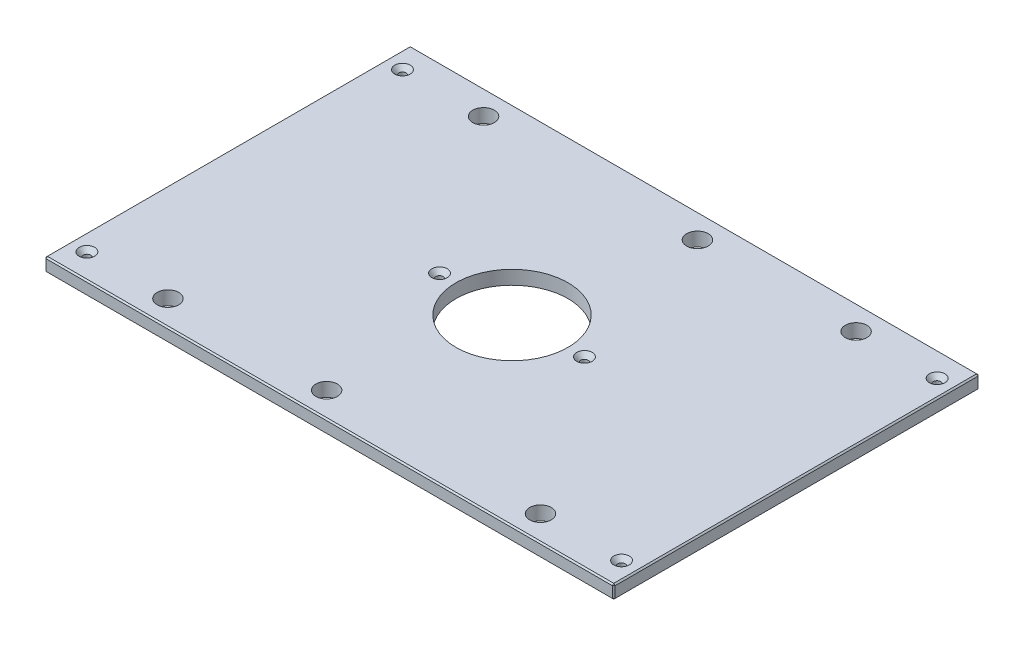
from build123d import *

# Parameters (mm, degrees)
SKETCH1_W                                        = 523.875
SKETCH1_H                                        = 336.55
BOSS_EXTRUDE1_DEPTH                              = 12.7
SKETCH13_R                                       = 51.562
CUT_EXTRUDE6_DEPTH                               = 312.591109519
F_25_32_0_78125_DIAMETER_HOLE1_D                 = 19.84375
CHAMFER2_SIZE                                    = 1.27
CSK_FOR_1_4_FLAT_HEAD_MACHINE_SCREW1_D           = 6.7564
CSK_FOR_1_4_FLAT_HEAD_MACHINE_SCREW1_CSINK_D     = 14.2748
CSK_FOR_1_4_FLAT_HEAD_MACHINE_SCREW1_CSINK_ANGLE = 82


with BuildPart() as part:
    # Sketch1 → Boss-Extrude1 (new body)
    with BuildSketch(Plane(origin=(0, 0, 0), x_dir=(1, 0, 0), z_dir=(0, 1, 0))):
        Rectangle(SKETCH1_W, SKETCH1_H)
    extrude(amount=BOSS_EXTRUDE1_DEPTH)

    # Sketch13 → Cut-Extrude6 (cut, through all)
    with BuildSketch(Plane(origin=(0, 12.7, 0), x_dir=(1, 0, 0), z_dir=(0, 1, 0))):
        with Locations(Location((0, 0, 0), (0, 0, 270))):
            Circle(SKETCH13_R)
    extrude(amount=-CUT_EXTRUDE6_DEPTH, mode=Mode.SUBTRACT)

    # 25_32 _0.78125_ Diameter Hole1 (through all)
    with Locations(Plane(origin=(0, 12.7, 0), x_dir=(1, 0, 0), z_dir=(0, 1, 0))):
        with Locations((171.45, 145.25498), (-171.45, 145.25498), (171.45, -145.25498), (-171.45, -145.25498), (25.4, 145.25498), (-25.4, -145.25498)):
            Hole(F_25_32_0_78125_DIAMETER_HOLE1_D / 2)

    # Chamfer2
    chamfer2_edges = [part.edges().sort_by_distance(p)[0] for p in [
        (261.9375, 12.7, 0),
        (0, 12.7, -168.275),
        (-261.9375, 12.7, 0),
        (0, 0, -168.275),
        (261.9375, 0, 0),
        (0, 0, 168.275),
        (-261.9375, 0, 0),
        (0, 12.7, 168.275),
        (-261.9375, 6.35, -168.275),
        (261.9375, 6.35, -168.275),
        (261.9375, 6.35, 168.275),
        (-261.9375, 6.35, 168.275),
    ]]
    chamfer(chamfer2_edges, length=CHAMFER2_SIZE)

    # CSK for 1_4 Flat Head Machine Screw1 (through all)
    with Locations(Plane(origin=(0, 12.7, 0), x_dir=(1, 0, 0), z_dir=(0, 1, 0))):
        with Locations((246.0625, 145.25498), (246.0625, -145.25498), (-246.0625, -145.25498), (-66.675, 0), (66.675, 0), (-246.0625, 145.25498), (-171.45, 145.25498), (-171.45, -145.25498)):
            CounterSinkHole(CSK_FOR_1_4_FLAT_HEAD_MACHINE_SCREW1_D / 2, CSK_FOR_1_4_FLAT_HEAD_MACHINE_SCREW1_CSINK_D / 2, counter_sink_angle=CSK_FOR_1_4_FLAT_HEAD_MACHINE_SCREW1_CSINK_ANGLE)


solid = part.part
